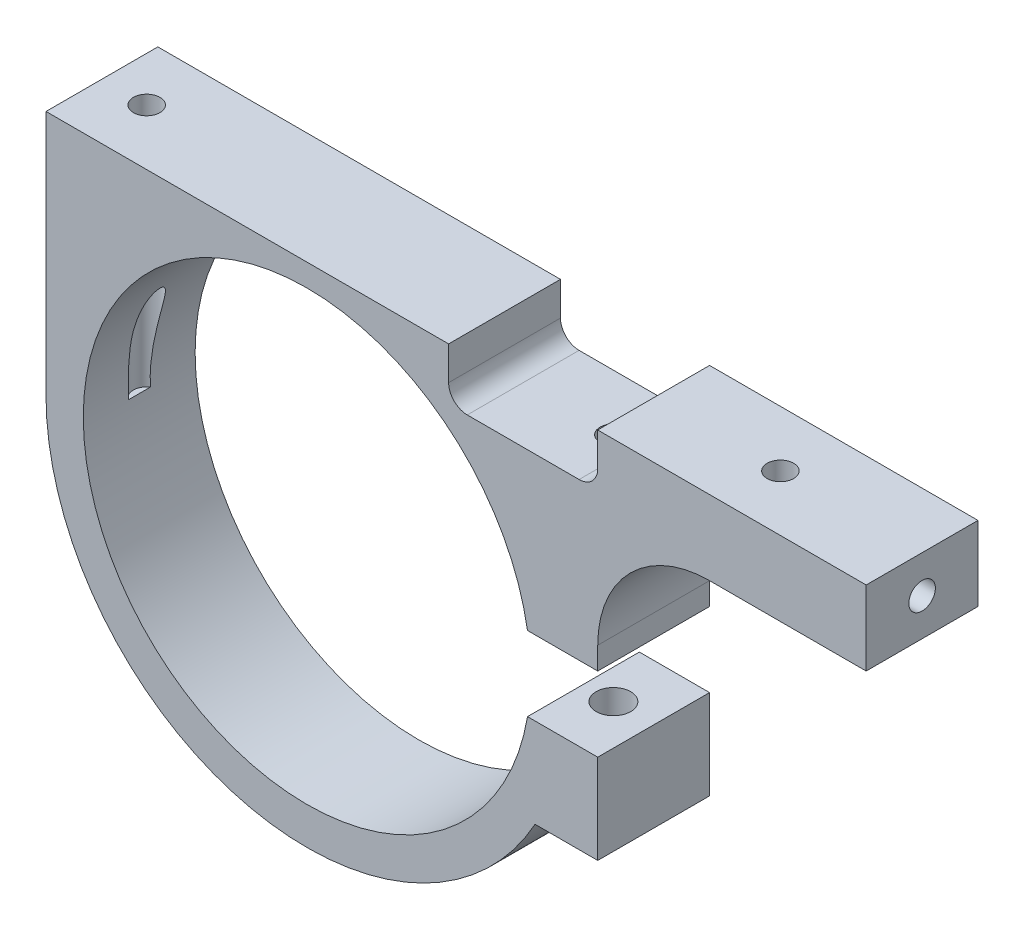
ISO-10303-21;
HEADER;
FILE_DESCRIPTION(('STEP AP214'),'2;1');
FILE_NAME('part.step','',(''),(''),'','','');
FILE_SCHEMA(('AUTOMOTIVE_DESIGN { 1 0 10303 214 1 1 1 1 }'));
ENDSEC;
DATA;
#1=APPLICATION_CONTEXT('core data for automotive mechanical design processes');
#2=APPLICATION_PROTOCOL_DEFINITION('international standard','automotive_design',2000,#1);
#3=PRODUCT_CONTEXT('',#1,'mechanical');
#4=PRODUCT('Part','Part','',(#3));
#5=PRODUCT_RELATED_PRODUCT_CATEGORY('part','',(#4));
#6=PRODUCT_DEFINITION_FORMATION('','',#4);
#7=PRODUCT_DEFINITION_CONTEXT('part definition',#1,'design');
#8=PRODUCT_DEFINITION('design','',#6,#7);
#9=PRODUCT_DEFINITION_SHAPE('','',#8);
#10=(LENGTH_UNIT() NAMED_UNIT(*) SI_UNIT(.MILLI.,.METRE.));
#11=(NAMED_UNIT(*) PLANE_ANGLE_UNIT() SI_UNIT($,.RADIAN.));
#12=(NAMED_UNIT(*) SI_UNIT($,.STERADIAN.) SOLID_ANGLE_UNIT());
#13=UNCERTAINTY_MEASURE_WITH_UNIT(LENGTH_MEASURE(1.E-05),#10,'distance_accuracy_value','');
#14=(GEOMETRIC_REPRESENTATION_CONTEXT(3) GLOBAL_UNCERTAINTY_ASSIGNED_CONTEXT((#13)) GLOBAL_UNIT_ASSIGNED_CONTEXT((#10,
#11,#12)) REPRESENTATION_CONTEXT('',''));
#15=CARTESIAN_POINT('',(0.,0.,0.));
#16=DIRECTION('',(0.,0.,1.));
#17=DIRECTION('',(1.,0.,0.));
#18=AXIS2_PLACEMENT_3D('',#15,#16,#17);
#19=CARTESIAN_POINT('',(0.,0.,4.7625));
#20=DIRECTION('',(0.,0.,-1.));
#21=DIRECTION('',(-1.,0.,0.));
#22=AXIS2_PLACEMENT_3D('',#19,#20,#21);
#23=CYLINDRICAL_SURFACE('',#22,22.225);
#24=CARTESIAN_POINT('',(19.4272643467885,-10.795,2.53719396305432));
#25=CARTESIAN_POINT('',(19.3666154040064,-10.9041738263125,2.49151799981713));
#26=CARTESIAN_POINT('',(19.3056095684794,-11.0117695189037,2.44225961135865));
#27=CARTESIAN_POINT('',(19.1834274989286,-11.2232597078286,2.33532574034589));
#28=CARTESIAN_POINT('',(19.1222515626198,-11.3271376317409,2.27761729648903));
#29=CARTESIAN_POINT('',(18.9998856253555,-11.531234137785,2.15197065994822));
#30=CARTESIAN_POINT('',(18.9387084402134,-11.6313772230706,2.08389550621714));
#31=CARTESIAN_POINT('',(18.8186000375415,-11.8247127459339,1.93708786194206));
#32=CARTESIAN_POINT('',(18.7596650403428,-11.9179171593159,1.85837442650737));
#33=CARTESIAN_POINT('',(18.6436628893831,-12.0986098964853,1.68614331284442));
#34=CARTESIAN_POINT('',(18.5867274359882,-12.185795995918,1.59221317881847));
#35=CARTESIAN_POINT('',(18.4796524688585,-12.3475686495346,1.39099372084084));
#36=CARTESIAN_POINT('',(18.4294935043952,-12.4221914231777,1.2837444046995));
#37=CARTESIAN_POINT('',(18.3384391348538,-12.5562318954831,1.05388028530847));
#38=CARTESIAN_POINT('',(18.2976833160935,-12.6154219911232,0.931071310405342));
#39=CARTESIAN_POINT('',(18.2472778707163,-12.688118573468,0.738143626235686));
#40=CARTESIAN_POINT('',(18.2322641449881,-12.7096692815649,0.672382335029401));
#41=CARTESIAN_POINT('',(18.2062490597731,-12.746906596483,0.53846132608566));
#42=CARTESIAN_POINT('',(18.1952466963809,-12.7625946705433,0.470302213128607));
#43=CARTESIAN_POINT('',(18.1713502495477,-12.7966168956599,0.28257868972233));
#44=CARTESIAN_POINT('',(18.1627671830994,-12.8087672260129,0.161233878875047));
#45=CARTESIAN_POINT('',(18.1597284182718,-12.8130752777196,-0.0818998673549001));
#46=CARTESIAN_POINT('',(18.1652658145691,-12.80524277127,-0.203688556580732));
#47=CARTESIAN_POINT('',(18.187964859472,-12.7729734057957,-0.425555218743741));
#48=CARTESIAN_POINT('',(18.2033183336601,-12.7511177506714,-0.526214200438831));
#49=CARTESIAN_POINT('',(18.2425996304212,-12.6948556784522,-0.722145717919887));
#50=CARTESIAN_POINT('',(18.2665288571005,-12.66044720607,-0.817417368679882));
#51=CARTESIAN_POINT('',(18.3316587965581,-12.5660360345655,-1.03530222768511));
#52=CARTESIAN_POINT('',(18.3759732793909,-12.5012738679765,-1.15491901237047));
#53=CARTESIAN_POINT('',(18.4739194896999,-12.3560772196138,-1.37995133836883));
#54=CARTESIAN_POINT('',(18.5275708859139,-12.2756096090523,-1.48533604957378));
#55=CARTESIAN_POINT('',(18.6688925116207,-12.060126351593,-1.73090110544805));
#56=CARTESIAN_POINT('',(18.7602688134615,-11.9178093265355,-1.86252962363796));
#57=CARTESIAN_POINT('',(18.9015283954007,-11.6914906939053,-2.03952834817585));
#58=CARTESIAN_POINT('',(18.9493942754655,-11.6137756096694,-2.0951933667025));
#59=CARTESIAN_POINT('',(19.0459509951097,-11.4547362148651,-2.20031597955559));
#60=CARTESIAN_POINT('',(19.0946415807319,-11.3734130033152,-2.24977544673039));
#61=CARTESIAN_POINT('',(19.1908646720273,-11.2102651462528,-2.34164875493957));
#62=CARTESIAN_POINT('',(19.2383884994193,-11.1285275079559,-2.38422851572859));
#63=CARTESIAN_POINT('',(19.3330927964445,-10.9631752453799,-2.46430186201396));
#64=CARTESIAN_POINT('',(19.3802735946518,-10.8795750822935,-2.50182484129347));
#65=CARTESIAN_POINT('',(19.4272643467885,-10.795,-2.53719396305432));
#66=B_SPLINE_CURVE_WITH_KNOTS('',3,(#24,#25,#26,#27,#28,#29,#30,#31,#32,#33,#34,#35,#36,#37,#38,
#39,#40,#41,#42,#43,#44,#45,#46,#47,#48,#49,#50,#51,#52,#53,#54,#55,#56,#57,#58,#59,#60,#61,#62,
#63,#64,#65),.UNSPECIFIED.,.F.,.F.,(4,2,2,2,2,2,2,2,2,2,2,2,2,2,2,2,2,2,2,2,4),(0.,
0.399026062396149,0.799652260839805,1.20612328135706,1.61187565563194,2.03142808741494,
2.44974945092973,2.87392987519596,3.08601822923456,3.29805346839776,3.66228868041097,
4.02634580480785,4.33744313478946,4.64859142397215,5.07536822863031,5.50305519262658,
6.14216261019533,6.46274643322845,6.78323326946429,7.09417881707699,7.40323083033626),.UNSPECIFIED.);
#67=CARTESIAN_POINT('',(19.4272643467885,-10.795,2.53719396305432));
#68=VERTEX_POINT('',#67);
#69=CARTESIAN_POINT('',(19.4272643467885,-10.795,-2.53719396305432));
#70=VERTEX_POINT('',#69);
#71=EDGE_CURVE('E190',#68,#70,#66,.T.);
#72=ORIENTED_EDGE('',*,*,#71,.F.);
#73=DIRECTION('',(0.,0.,-1.));
#74=VECTOR('',#73,1.);
#75=CARTESIAN_POINT('',(19.4272643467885,-10.795,4.7625));
#76=LINE('',#75,#74);
#77=CARTESIAN_POINT('',(19.4272643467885,-10.795,4.7625));
#78=VERTEX_POINT('',#77);
#79=EDGE_CURVE('E196',#78,#68,#76,.T.);
#80=ORIENTED_EDGE('',*,*,#79,.F.);
#81=CARTESIAN_POINT('',(0.,0.,4.7625));
#82=DIRECTION('',(0.,0.,1.));
#83=DIRECTION('',(1.,0.,0.));
#84=AXIS2_PLACEMENT_3D('',#81,#82,#83);
#85=CIRCLE('',#84,22.225);
#86=CARTESIAN_POINT('',(-22.225,0.,4.7625));
#87=VERTEX_POINT('',#86);
#88=EDGE_CURVE('E384',#87,#78,#85,.T.);
#89=ORIENTED_EDGE('',*,*,#88,.F.);
#90=DIRECTION('',(0.,0.,-1.));
#91=VECTOR('',#90,1.);
#92=CARTESIAN_POINT('',(-22.225,0.,4.7625));
#93=LINE('',#92,#91);
#94=CARTESIAN_POINT('',(-22.225,0.,-4.7625));
#95=VERTEX_POINT('',#94);
#96=EDGE_CURVE('E206',#87,#95,#93,.T.);
#97=ORIENTED_EDGE('',*,*,#96,.T.);
#98=CARTESIAN_POINT('',(0.,0.,-4.7625));
#99=DIRECTION('',(0.,0.,1.));
#100=DIRECTION('',(1.,0.,0.));
#101=AXIS2_PLACEMENT_3D('',#98,#99,#100);
#102=CIRCLE('',#101,22.225);
#103=CARTESIAN_POINT('',(19.4272643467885,-10.795,-4.7625));
#104=VERTEX_POINT('',#103);
#105=EDGE_CURVE('E420',#95,#104,#102,.T.);
#106=ORIENTED_EDGE('',*,*,#105,.T.);
#107=EDGE_CURVE('E199',#70,#104,#76,.T.);
#108=ORIENTED_EDGE('',*,*,#107,.F.);
#109=EDGE_LOOP('',(#72,#80,#89,#97,#106,#108));
#110=FACE_BOUND('',#109,.T.);
#111=ADVANCED_FACE('F34',(#110),#23,.T.);
#112=CARTESIAN_POINT('',(12.065,20.955,4.7625));
#113=DIRECTION('',(-1.,0.,0.));
#114=DIRECTION('',(0.,-1.,0.));
#115=AXIS2_PLACEMENT_3D('',#112,#113,#114);
#116=PLANE('',#115);
#117=DIRECTION('',(0.,1.,0.));
#118=VECTOR('',#117,1.);
#119=CARTESIAN_POINT('',(12.065,20.955,-4.7625));
#120=LINE('',#119,#118);
#121=CARTESIAN_POINT('',(12.065,18.0975,-4.7625));
#122=VERTEX_POINT('',#121);
#123=CARTESIAN_POINT('',(12.065,20.955,-4.7625));
#124=VERTEX_POINT('',#123);
#125=EDGE_CURVE('E375',#122,#124,#120,.T.);
#126=ORIENTED_EDGE('',*,*,#125,.T.);
#127=DIRECTION('',(0.,0.,-1.));
#128=VECTOR('',#127,1.);
#129=CARTESIAN_POINT('',(12.065,20.955,4.7625));
#130=LINE('',#129,#128);
#131=CARTESIAN_POINT('',(12.065,20.955,4.7625));
#132=VERTEX_POINT('',#131);
#133=EDGE_CURVE('E217',#132,#124,#130,.T.);
#134=ORIENTED_EDGE('',*,*,#133,.F.);
#135=DIRECTION('',(0.,1.,0.));
#136=VECTOR('',#135,1.);
#137=CARTESIAN_POINT('',(12.065,20.955,4.7625));
#138=LINE('',#137,#136);
#139=CARTESIAN_POINT('',(12.065,18.0975,4.7625));
#140=VERTEX_POINT('',#139);
#141=EDGE_CURVE('E376',#140,#132,#138,.T.);
#142=ORIENTED_EDGE('',*,*,#141,.F.);
#143=DIRECTION('',(0.,0.,-1.));
#144=VECTOR('',#143,1.);
#145=CARTESIAN_POINT('',(12.065,18.0975,4.7625));
#146=LINE('',#145,#144);
#147=EDGE_CURVE('E413',#140,#122,#146,.T.);
#148=ORIENTED_EDGE('',*,*,#147,.T.);
#149=EDGE_LOOP('',(#126,#134,#142,#148));
#150=FACE_BOUND('',#149,.T.);
#151=ADVANCED_FACE('F36',(#150),#116,.F.);
#152=CARTESIAN_POINT('',(-22.225,20.955,4.7625));
#153=DIRECTION('',(0.,-1.,0.));
#154=DIRECTION('',(1.,0.,0.));
#155=AXIS2_PLACEMENT_3D('',#152,#153,#154);
#156=PLANE('',#155);
#157=CARTESIAN_POINT('',(-18.415,20.955,0.));
#158=DIRECTION('',(0.,1.,0.));
#159=DIRECTION('',(0.,0.,1.));
#160=AXIS2_PLACEMENT_3D('',#157,#158,#159);
#161=CIRCLE('',#160,1.1303);
#162=CARTESIAN_POINT('',(-18.415,20.955,1.1303));
#163=VERTEX_POINT('',#162);
#164=EDGE_CURVE('E363',#163,#163,#161,.T.);
#165=ORIENTED_EDGE('',*,*,#164,.F.);
#166=EDGE_LOOP('',(#165));
#167=FACE_BOUND('',#166,.T.);
#168=DIRECTION('',(-1.,0.,0.));
#169=VECTOR('',#168,1.);
#170=CARTESIAN_POINT('',(-22.225,20.955,-4.7625));
#171=LINE('',#170,#169);
#172=CARTESIAN_POINT('',(-22.225,20.955,-4.7625));
#173=VERTEX_POINT('',#172);
#174=EDGE_CURVE('E416',#124,#173,#171,.T.);
#175=ORIENTED_EDGE('',*,*,#174,.T.);
#176=DIRECTION('',(0.,0.,-1.));
#177=VECTOR('',#176,1.);
#178=CARTESIAN_POINT('',(-22.225,20.955,4.7625));
#179=LINE('',#178,#177);
#180=CARTESIAN_POINT('',(-22.225,20.955,4.7625));
#181=VERTEX_POINT('',#180);
#182=EDGE_CURVE('E209',#181,#173,#179,.T.);
#183=ORIENTED_EDGE('',*,*,#182,.F.);
#184=DIRECTION('',(-1.,0.,0.));
#185=VECTOR('',#184,1.);
#186=CARTESIAN_POINT('',(-22.225,20.955,4.7625));
#187=LINE('',#186,#185);
#188=EDGE_CURVE('E379',#132,#181,#187,.T.);
#189=ORIENTED_EDGE('',*,*,#188,.F.);
#190=ORIENTED_EDGE('',*,*,#133,.T.);
#191=EDGE_LOOP('',(#175,#183,#189,#190));
#192=FACE_BOUND('',#191,.T.);
#193=ADVANCED_FACE('F315',(#167,#192),#156,.F.);
#194=CARTESIAN_POINT('',(-22.225,20.955,4.7625));
#195=DIRECTION('',(1.,0.,0.));
#196=DIRECTION('',(0.,1.,0.));
#197=AXIS2_PLACEMENT_3D('',#194,#195,#196);
#198=PLANE('',#197);
#199=DIRECTION('',(0.,-1.,0.));
#200=VECTOR('',#199,1.);
#201=CARTESIAN_POINT('',(-22.225,20.955,-4.7625));
#202=LINE('',#201,#200);
#203=EDGE_CURVE('E418',#173,#95,#202,.T.);
#204=ORIENTED_EDGE('',*,*,#203,.T.);
#205=ORIENTED_EDGE('',*,*,#96,.F.);
#206=DIRECTION('',(0.,-1.,0.));
#207=VECTOR('',#206,1.);
#208=CARTESIAN_POINT('',(-22.225,20.955,4.7625));
#209=LINE('',#208,#207);
#210=EDGE_CURVE('E382',#181,#87,#209,.T.);
#211=ORIENTED_EDGE('',*,*,#210,.F.);
#212=ORIENTED_EDGE('',*,*,#182,.T.);
#213=EDGE_LOOP('',(#204,#205,#211,#212));
#214=FACE_BOUND('',#213,.T.);
#215=ADVANCED_FACE('F321',(#214),#198,.F.);
#216=CARTESIAN_POINT('',(24.765,-10.795,4.7625));
#217=DIRECTION('',(0.,1.,0.));
#218=DIRECTION('',(-1.,0.,0.));
#219=AXIS2_PLACEMENT_3D('',#216,#217,#218);
#220=PLANE('',#219);
#221=ORIENTED_EDGE('',*,*,#79,.T.);
#222=CARTESIAN_POINT('',(21.336,-10.795,0.));
#223=DIRECTION('',(0.,-1.,0.));
#224=DIRECTION('',(1.,0.,0.));
#225=AXIS2_PLACEMENT_3D('',#222,#223,#224);
#226=CIRCLE('',#225,3.175);
#227=EDGE_CURVE('E51',#68,#70,#226,.T.);
#228=ORIENTED_EDGE('',*,*,#227,.T.);
#229=ORIENTED_EDGE('',*,*,#107,.T.);
#230=DIRECTION('',(1.,0.,0.));
#231=VECTOR('',#230,1.);
#232=CARTESIAN_POINT('',(24.765,-10.795,-4.7625));
#233=LINE('',#232,#231);
#234=CARTESIAN_POINT('',(24.765,-10.795,-4.7625));
#235=VERTEX_POINT('',#234);
#236=EDGE_CURVE('E422',#104,#235,#233,.T.);
#237=ORIENTED_EDGE('',*,*,#236,.T.);
#238=DIRECTION('',(0.,0.,-1.));
#239=VECTOR('',#238,1.);
#240=CARTESIAN_POINT('',(24.765,-10.795,4.7625));
#241=LINE('',#240,#239);
#242=CARTESIAN_POINT('',(24.765,-10.795,4.7625));
#243=VERTEX_POINT('',#242);
#244=EDGE_CURVE('E211',#243,#235,#241,.T.);
#245=ORIENTED_EDGE('',*,*,#244,.F.);
#246=DIRECTION('',(1.,0.,0.));
#247=VECTOR('',#246,1.);
#248=CARTESIAN_POINT('',(24.765,-10.795,4.7625));
#249=LINE('',#248,#247);
#250=EDGE_CURVE('E205',#78,#243,#249,.T.);
#251=ORIENTED_EDGE('',*,*,#250,.F.);
#252=EDGE_LOOP('',(#221,#228,#229,#237,#245,#251));
#253=FACE_BOUND('',#252,.T.);
#254=CARTESIAN_POINT('',(21.336,-10.795,0.));
#255=DIRECTION('',(0.,-1.,0.));
#256=DIRECTION('',(1.,0.,0.));
#257=AXIS2_PLACEMENT_3D('',#254,#255,#256);
#258=CIRCLE('',#257,1.4732);
#259=CARTESIAN_POINT('',(22.8092,-10.795,0.));
#260=VERTEX_POINT('',#259);
#261=EDGE_CURVE('E355',#260,#260,#258,.T.);
#262=ORIENTED_EDGE('',*,*,#261,.F.);
#263=EDGE_LOOP('',(#262));
#264=FACE_BOUND('',#263,.T.);
#265=ADVANCED_FACE('F202',(#253,#264),#220,.F.);
#266=CARTESIAN_POINT('',(24.765,-10.795,4.7625));
#267=DIRECTION('',(-1.,0.,0.));
#268=DIRECTION('',(0.,0.,1.));
#269=AXIS2_PLACEMENT_3D('',#266,#267,#268);
#270=PLANE('',#269);
#271=DIRECTION('',(0.,1.,0.));
#272=VECTOR('',#271,1.);
#273=CARTESIAN_POINT('',(24.765,-10.795,-4.7625));
#274=LINE('',#273,#272);
#275=CARTESIAN_POINT('',(24.765,-3.175,-4.7625));
#276=VERTEX_POINT('',#275);
#277=EDGE_CURVE('E424',#235,#276,#274,.T.);
#278=ORIENTED_EDGE('',*,*,#277,.T.);
#279=DIRECTION('',(0.,0.,-1.));
#280=VECTOR('',#279,1.);
#281=CARTESIAN_POINT('',(24.765,-3.175,4.7625));
#282=LINE('',#281,#280);
#283=CARTESIAN_POINT('',(24.765,-3.175,4.7625));
#284=VERTEX_POINT('',#283);
#285=EDGE_CURVE('E483',#284,#276,#282,.T.);
#286=ORIENTED_EDGE('',*,*,#285,.F.);
#287=DIRECTION('',(0.,1.,0.));
#288=VECTOR('',#287,1.);
#289=CARTESIAN_POINT('',(24.765,-10.795,4.7625));
#290=LINE('',#289,#288);
#291=EDGE_CURVE('E387',#243,#284,#290,.T.);
#292=ORIENTED_EDGE('',*,*,#291,.F.);
#293=ORIENTED_EDGE('',*,*,#244,.T.);
#294=EDGE_LOOP('',(#278,#286,#292,#293));
#295=FACE_BOUND('',#294,.T.);
#296=ADVANCED_FACE('F493',(#295),#270,.F.);
#297=CARTESIAN_POINT('',(24.765,-3.175,4.7625));
#298=DIRECTION('',(0.,-1.,0.));
#299=DIRECTION('',(1.,0.,0.));
#300=AXIS2_PLACEMENT_3D('',#297,#298,#299);
#301=PLANE('',#300);
#302=CARTESIAN_POINT('',(21.336,-3.175,0.));
#303=DIRECTION('',(0.,-1.,0.));
#304=DIRECTION('',(1.,0.,0.));
#305=AXIS2_PLACEMENT_3D('',#302,#303,#304);
#306=CIRCLE('',#305,1.4732);
#307=CARTESIAN_POINT('',(22.8092,-3.175,0.));
#308=VERTEX_POINT('',#307);
#309=EDGE_CURVE('E358',#308,#308,#306,.F.);
#310=ORIENTED_EDGE('',*,*,#309,.F.);
#311=EDGE_LOOP('',(#310));
#312=FACE_BOUND('',#311,.T.);
#313=DIRECTION('',(-1.,0.,0.));
#314=VECTOR('',#313,1.);
#315=CARTESIAN_POINT('',(24.765,-3.175,-4.7625));
#316=LINE('',#315,#314);
#317=CARTESIAN_POINT('',(18.7835533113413,-3.175,-4.7625));
#318=VERTEX_POINT('',#317);
#319=EDGE_CURVE('E426',#276,#318,#316,.T.);
#320=ORIENTED_EDGE('',*,*,#319,.T.);
#321=DIRECTION('',(0.,0.,-1.));
#322=VECTOR('',#321,1.);
#323=CARTESIAN_POINT('',(18.7835533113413,-3.175,4.7625));
#324=LINE('',#323,#322);
#325=CARTESIAN_POINT('',(18.7835533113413,-3.175,4.7625));
#326=VERTEX_POINT('',#325);
#327=EDGE_CURVE('E481',#326,#318,#324,.T.);
#328=ORIENTED_EDGE('',*,*,#327,.F.);
#329=DIRECTION('',(-1.,0.,0.));
#330=VECTOR('',#329,1.);
#331=CARTESIAN_POINT('',(24.765,-3.175,4.7625));
#332=LINE('',#331,#330);
#333=EDGE_CURVE('E389',#284,#326,#332,.T.);
#334=ORIENTED_EDGE('',*,*,#333,.F.);
#335=ORIENTED_EDGE('',*,*,#285,.T.);
#336=EDGE_LOOP('',(#320,#328,#334,#335));
#337=FACE_BOUND('',#336,.T.);
#338=ADVANCED_FACE('F306',(#312,#337),#301,.F.);
#339=CARTESIAN_POINT('',(0.,0.,4.7625));
#340=DIRECTION('',(0.,0.,-1.));
#341=DIRECTION('',(-1.,0.,0.));
#342=AXIS2_PLACEMENT_3D('',#339,#340,#341);
#343=CYLINDRICAL_SURFACE('',#342,19.05);
#344=DIRECTION('',(0.,0.,-1.));
#345=VECTOR('',#344,1.);
#346=CARTESIAN_POINT('',(-19.0394137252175,-0.635000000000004,4.7625));
#347=LINE('',#346,#345);
#348=CARTESIAN_POINT('',(-19.0394137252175,-0.635000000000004,0.942170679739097));
#349=VERTEX_POINT('',#348);
#350=CARTESIAN_POINT('',(-19.0394137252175,-0.635000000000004,-0.942170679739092));
#351=VERTEX_POINT('',#350);
#352=EDGE_CURVE('E220',#349,#351,#347,.T.);
#353=ORIENTED_EDGE('',*,*,#352,.F.);
#354=CARTESIAN_POINT('',(-19.0394137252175,-0.635000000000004,0.942170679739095));
#355=CARTESIAN_POINT('',(-19.0425563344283,-0.540775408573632,0.940084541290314));
#356=CARTESIAN_POINT('',(-19.0449996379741,-0.446519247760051,0.938446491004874));
#357=CARTESIAN_POINT('',(-19.0484866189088,-0.257969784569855,0.936097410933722));
#358=CARTESIAN_POINT('',(-19.0495302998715,-0.163676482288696,0.935386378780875));
#359=CARTESIAN_POINT('',(-19.0505603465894,0.119204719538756,0.93469010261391));
#360=CARTESIAN_POINT('',(-19.0484462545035,0.307810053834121,0.936141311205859));
#361=CARTESIAN_POINT('',(-19.0385992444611,0.685651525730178,0.942727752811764));
#362=CARTESIAN_POINT('',(-19.0308411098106,0.874886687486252,0.947879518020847));
#363=CARTESIAN_POINT('',(-19.0096960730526,1.25291284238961,0.961285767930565));
#364=CARTESIAN_POINT('',(-18.9963096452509,1.44170387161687,0.969539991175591));
#365=CARTESIAN_POINT('',(-18.9638095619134,1.82009805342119,0.988301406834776));
#366=CARTESIAN_POINT('',(-18.944653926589,2.00969675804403,0.998824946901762));
#367=CARTESIAN_POINT('',(-18.9006710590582,2.38818645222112,1.0209343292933));
#368=CARTESIAN_POINT('',(-18.8758433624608,2.5770773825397,1.03252025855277));
#369=CARTESIAN_POINT('',(-18.8204991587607,2.95426608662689,1.05548429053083));
#370=CARTESIAN_POINT('',(-18.7899759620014,3.14256289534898,1.06686213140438));
#371=CARTESIAN_POINT('',(-18.7232709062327,3.51824106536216,1.0880128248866));
#372=CARTESIAN_POINT('',(-18.6870892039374,3.70562245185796,1.0977857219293));
#373=CARTESIAN_POINT('',(-18.6092448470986,4.07855810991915,1.11419188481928));
#374=CARTESIAN_POINT('',(-18.5676061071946,4.26411676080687,1.12083830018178));
#375=CARTESIAN_POINT('',(-18.4787663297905,4.63398917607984,1.12938287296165));
#376=CARTESIAN_POINT('',(-18.4315663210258,4.81830316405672,1.13128190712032));
#377=CARTESIAN_POINT('',(-18.3317732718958,5.18503938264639,1.1283350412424));
#378=CARTESIAN_POINT('',(-18.2791910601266,5.36746462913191,1.12350244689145));
#379=CARTESIAN_POINT('',(-18.168745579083,5.73018894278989,1.10457742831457));
#380=CARTESIAN_POINT('',(-18.1108853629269,5.91048917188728,1.09049032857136));
#381=CARTESIAN_POINT('',(-18.0166610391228,6.18980697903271,1.05838471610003));
#382=CARTESIAN_POINT('',(-17.9819603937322,6.28989296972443,1.0447787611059));
#383=CARTESIAN_POINT('',(-17.9111337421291,6.4888312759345,1.01253010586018));
#384=CARTESIAN_POINT('',(-17.8750069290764,6.58768285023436,0.993884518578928));
#385=CARTESIAN_POINT('',(-17.8015372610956,6.78371179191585,0.950299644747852));
#386=CARTESIAN_POINT('',(-17.7641928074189,6.88088667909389,0.925351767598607));
#387=CARTESIAN_POINT('',(-17.6887773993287,7.07249655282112,0.867439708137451));
#388=CARTESIAN_POINT('',(-17.6507073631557,7.1669346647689,0.834485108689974));
#389=CARTESIAN_POINT('',(-17.5934766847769,7.30579470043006,0.776796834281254));
#390=CARTESIAN_POINT('',(-17.574274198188,7.35185763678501,0.756055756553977));
#391=CARTESIAN_POINT('',(-17.5360969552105,7.44246010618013,0.711319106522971));
#392=CARTESIAN_POINT('',(-17.5171220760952,7.48700048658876,0.687325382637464));
#393=CARTESIAN_POINT('',(-17.4798090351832,7.57370377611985,0.63561484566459));
#394=CARTESIAN_POINT('',(-17.4614674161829,7.61588081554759,0.60792451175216));
#395=CARTESIAN_POINT('',(-17.4257675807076,7.69721274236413,0.547919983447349));
#396=CARTESIAN_POINT('',(-17.4084075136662,7.73637337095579,0.515614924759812));
#397=CARTESIAN_POINT('',(-17.3809690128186,7.79776516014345,0.457185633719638));
#398=CARTESIAN_POINT('',(-17.3704037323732,7.82126375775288,0.432631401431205));
#399=CARTESIAN_POINT('',(-17.3503810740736,7.86558112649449,0.380709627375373));
#400=CARTESIAN_POINT('',(-17.3409248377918,7.88639713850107,0.353339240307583));
#401=CARTESIAN_POINT('',(-17.3235326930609,7.92452896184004,0.295304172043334));
#402=CARTESIAN_POINT('',(-17.3156144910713,7.94180412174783,0.264606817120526));
#403=CARTESIAN_POINT('',(-17.3021172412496,7.97116699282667,0.200346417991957));
#404=CARTESIAN_POINT('',(-17.2965325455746,7.98326723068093,0.166790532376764));
#405=CARTESIAN_POINT('',(-17.2893604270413,7.99878559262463,0.105908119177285));
#406=CARTESIAN_POINT('',(-17.2871364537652,8.00358801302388,0.0790110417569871));
#407=CARTESIAN_POINT('',(-17.2846442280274,8.00896895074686,0.0247091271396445));
#408=CARTESIAN_POINT('',(-17.2843747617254,8.00955008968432,-0.0026953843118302));
#409=CARTESIAN_POINT('',(-17.2858184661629,8.00643380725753,-0.0571854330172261));
#410=CARTESIAN_POINT('',(-17.2875305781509,8.00273867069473,-0.0842711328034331));
#411=CARTESIAN_POINT('',(-17.292766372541,7.99141847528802,-0.137423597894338));
#412=CARTESIAN_POINT('',(-17.2962915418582,7.98379019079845,-0.163489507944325));
#413=CARTESIAN_POINT('',(-17.3063618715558,7.96194240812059,-0.222929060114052));
#414=CARTESIAN_POINT('',(-17.3135310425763,7.9463530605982,-0.255689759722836));
#415=CARTESIAN_POINT('',(-17.329890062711,7.91061304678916,-0.318056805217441));
#416=CARTESIAN_POINT('',(-17.3390844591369,7.89045211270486,-0.347655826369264));
#417=CARTESIAN_POINT('',(-17.3650148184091,7.83327840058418,-0.421244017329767));
#418=CARTESIAN_POINT('',(-17.3828835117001,7.79358574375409,-0.462726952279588));
#419=CARTESIAN_POINT('',(-17.4205471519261,7.70903384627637,-0.538936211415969));
#420=CARTESIAN_POINT('',(-17.4403470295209,7.664161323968,-0.573644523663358));
#421=CARTESIAN_POINT('',(-17.4810900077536,7.57077338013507,-0.637842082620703));
#422=CARTESIAN_POINT('',(-17.5020409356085,7.52223186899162,-0.667287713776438));
#423=CARTESIAN_POINT('',(-17.5444142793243,7.42286688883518,-0.721697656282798));
#424=CARTESIAN_POINT('',(-17.5658371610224,7.37204110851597,-0.746657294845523));
#425=CARTESIAN_POINT('',(-17.6088516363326,7.2686989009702,-0.792906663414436));
#426=CARTESIAN_POINT('',(-17.6304434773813,7.21617937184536,-0.814189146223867));
#427=CARTESIAN_POINT('',(-17.6735371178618,7.10998390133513,-0.853616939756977));
#428=CARTESIAN_POINT('',(-17.6950389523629,7.05630847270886,-0.871763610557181));
#429=CARTESIAN_POINT('',(-17.7489973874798,6.91978562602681,-0.914187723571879));
#430=CARTESIAN_POINT('',(-17.7813116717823,6.83634032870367,-0.93671874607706));
#431=CARTESIAN_POINT('',(-17.8451390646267,6.66795557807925,-0.976859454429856));
#432=CARTESIAN_POINT('',(-17.8766517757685,6.58301541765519,-0.994466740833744));
#433=CARTESIAN_POINT('',(-17.9387375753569,6.4119022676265,-1.02565147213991));
#434=CARTESIAN_POINT('',(-17.9693090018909,6.32572745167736,-1.03922211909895));
#435=CARTESIAN_POINT('',(-18.0293474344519,6.15252301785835,-1.06296251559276));
#436=CARTESIAN_POINT('',(-18.0588142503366,6.06549325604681,-1.07313168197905));
#437=CARTESIAN_POINT('',(-18.1457432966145,5.80247332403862,-1.09944291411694));
#438=CARTESIAN_POINT('',(-18.2014083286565,5.62544929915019,-1.1112378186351));
#439=CARTESIAN_POINT('',(-18.3075551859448,5.26975987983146,-1.12645026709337));
#440=CARTESIAN_POINT('',(-18.3580421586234,5.09109631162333,-1.12987620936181));
#441=CARTESIAN_POINT('',(-18.4661780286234,4.68587242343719,-1.13075100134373));
#442=CARTESIAN_POINT('',(-18.5222912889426,4.4589008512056,-1.12642039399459));
#443=CARTESIAN_POINT('',(-18.626096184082,4.00320929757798,-1.11164613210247));
#444=CARTESIAN_POINT('',(-18.6737854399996,3.77448884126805,-1.10120075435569));
#445=CARTESIAN_POINT('',(-18.7607563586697,3.31529820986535,-1.07706497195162));
#446=CARTESIAN_POINT('',(-18.8000260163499,3.08482601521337,-1.06336999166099));
#447=CARTESIAN_POINT('',(-18.8700541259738,2.62263069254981,-1.03533859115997));
#448=CARTESIAN_POINT('',(-18.9008124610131,2.3909075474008,-1.02100216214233));
#449=CARTESIAN_POINT('',(-18.9536751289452,1.92739887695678,-0.994125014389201));
#450=CARTESIAN_POINT('',(-18.9758167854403,1.69561807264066,-0.981576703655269));
#451=CARTESIAN_POINT('',(-19.0115980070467,1.23120911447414,-0.960253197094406));
#452=CARTESIAN_POINT('',(-19.0252372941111,0.99858093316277,-0.951478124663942));
#453=CARTESIAN_POINT('',(-19.0439618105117,0.533110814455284,-0.939209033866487));
#454=CARTESIAN_POINT('',(-19.0490570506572,0.30026944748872,-0.935708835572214));
#455=CARTESIAN_POINT('',(-19.0507043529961,-0.165432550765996,-0.934590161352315));
#456=CARTESIAN_POINT('',(-19.0472579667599,-0.398293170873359,-0.936970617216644));
#457=CARTESIAN_POINT('',(-19.0395043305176,-0.63227897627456,-0.942110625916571));
#458=CARTESIAN_POINT('',(-19.039459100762,-0.633639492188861,-0.942140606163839));
#459=CARTESIAN_POINT('',(-19.0394137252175,-0.635,-0.942170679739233));
#460=B_SPLINE_CURVE_WITH_KNOTS('',3,(#354,#355,#356,#357,#358,#359,#360,#361,#362,#363,#364,
#365,#366,#367,#368,#369,#370,#371,#372,#373,#374,#375,#376,#377,#378,#379,#380,#381,#382,#383,
#384,#385,#386,#387,#388,#389,#390,#391,#392,#393,#394,#395,#396,#397,#398,#399,#400,#401,#402,
#403,#404,#405,#406,#407,#408,#409,#410,#411,#412,#413,#414,#415,#416,#417,#418,#419,#420,#421,
#422,#423,#424,#425,#426,#427,#428,#429,#430,#431,#432,#433,#434,#435,#436,#437,#438,#439,#440,
#441,#442,#443,#444,#445,#446,#447,#448,#449,#450,#451,#452,#453,#454,#455,#456,#457,#458,#459),
.UNSPECIFIED.,.F.,.F.,(4,2,2,2,2,2,2,2,2,2,2,2,2,2,2,2,2,2,2,2,2,2,2,2,2,2,2,2,2,2,2,2,2,2,2,2,
2,2,2,2,2,2,2,2,2,2,2,2,2,2,2,2,4),(0.,0.282893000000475,0.565785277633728,1.13152140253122,
1.69980079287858,2.26803230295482,2.84050278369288,3.41302015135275,3.98621425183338,
4.55939248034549,5.13013796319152,5.70077803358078,6.27029178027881,6.83947814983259,
7.15977835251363,7.48026243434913,7.80118574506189,8.12172683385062,8.28376761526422,
8.44571669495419,8.60656241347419,8.76709401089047,8.87369065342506,8.98039607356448,
9.08826528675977,9.19587188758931,9.27774383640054,9.35956493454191,9.44134233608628,
9.52318691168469,9.63350846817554,9.74408030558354,9.92345502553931,10.1033003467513,
10.2845732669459,10.4660339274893,10.6478482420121,10.8295835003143,11.106212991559,
11.382977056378,11.6602046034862,11.9374796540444,12.4949209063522,13.0518025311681,
13.753029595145,14.4544543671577,15.1568727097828,15.8593006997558,16.5586512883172,
17.2580247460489,17.9565781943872,18.6550047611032,18.6590895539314),.UNSPECIFIED.);
#461=EDGE_CURVE('E227',#349,#351,#460,.T.);
#462=ORIENTED_EDGE('',*,*,#461,.T.);
#463=EDGE_LOOP('',(#353,#462));
#464=FACE_BOUND('',#463,.T.);
#465=CARTESIAN_POINT('',(0.,0.,-4.7625));
#466=DIRECTION('',(0.,0.,-1.));
#467=DIRECTION('',(1.,0.,0.));
#468=AXIS2_PLACEMENT_3D('',#465,#466,#467);
#469=CIRCLE('',#468,19.05);
#470=CARTESIAN_POINT('',(18.7835533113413,3.175,-4.7625));
#471=VERTEX_POINT('',#470);
#472=EDGE_CURVE('E428',#318,#471,#469,.T.);
#473=ORIENTED_EDGE('',*,*,#472,.T.);
#474=DIRECTION('',(0.,0.,-1.));
#475=VECTOR('',#474,1.);
#476=CARTESIAN_POINT('',(18.7835533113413,3.175,4.7625));
#477=LINE('',#476,#475);
#478=CARTESIAN_POINT('',(18.7835533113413,3.175,4.7625));
#479=VERTEX_POINT('',#478);
#480=EDGE_CURVE('E478',#479,#471,#477,.T.);
#481=ORIENTED_EDGE('',*,*,#480,.F.);
#482=CARTESIAN_POINT('',(0.,0.,4.7625));
#483=DIRECTION('',(0.,0.,-1.));
#484=DIRECTION('',(1.,0.,0.));
#485=AXIS2_PLACEMENT_3D('',#482,#483,#484);
#486=CIRCLE('',#485,19.05);
#487=EDGE_CURVE('E391',#326,#479,#486,.T.);
#488=ORIENTED_EDGE('',*,*,#487,.F.);
#489=ORIENTED_EDGE('',*,*,#327,.T.);
#490=EDGE_LOOP('',(#473,#481,#488,#489));
#491=FACE_BOUND('',#490,.T.);
#492=ADVANCED_FACE('F237',(#464,#491),#343,.F.);
#493=CARTESIAN_POINT('',(24.765,3.175,4.7625));
#494=DIRECTION('',(0.,1.,0.));
#495=DIRECTION('',(-1.,0.,0.));
#496=AXIS2_PLACEMENT_3D('',#493,#494,#495);
#497=PLANE('',#496);
#498=CARTESIAN_POINT('',(21.336,3.175,0.));
#499=DIRECTION('',(0.,1.,0.));
#500=DIRECTION('',(-1.,0.,0.));
#501=AXIS2_PLACEMENT_3D('',#498,#499,#500);
#502=CIRCLE('',#501,1.1303);
#503=CARTESIAN_POINT('',(20.2057,3.175,0.));
#504=VERTEX_POINT('',#503);
#505=EDGE_CURVE('E224',#504,#504,#502,.T.);
#506=ORIENTED_EDGE('',*,*,#505,.T.);
#507=EDGE_LOOP('',(#506));
#508=FACE_BOUND('',#507,.T.);
#509=DIRECTION('',(1.,0.,0.));
#510=VECTOR('',#509,1.);
#511=CARTESIAN_POINT('',(24.765,3.175,-4.7625));
#512=LINE('',#511,#510);
#513=CARTESIAN_POINT('',(24.765,3.175,-4.7625));
#514=VERTEX_POINT('',#513);
#515=EDGE_CURVE('E430',#471,#514,#512,.T.);
#516=ORIENTED_EDGE('',*,*,#515,.T.);
#517=DIRECTION('',(0.,0.,-1.));
#518=VECTOR('',#517,1.);
#519=CARTESIAN_POINT('',(24.765,3.175,4.7625));
#520=LINE('',#519,#518);
#521=CARTESIAN_POINT('',(24.765,3.175,4.7625));
#522=VERTEX_POINT('',#521);
#523=EDGE_CURVE('E475',#522,#514,#520,.T.);
#524=ORIENTED_EDGE('',*,*,#523,.F.);
#525=DIRECTION('',(1.,0.,0.));
#526=VECTOR('',#525,1.);
#527=CARTESIAN_POINT('',(24.765,3.175,4.7625));
#528=LINE('',#527,#526);
#529=EDGE_CURVE('E393',#479,#522,#528,.T.);
#530=ORIENTED_EDGE('',*,*,#529,.F.);
#531=ORIENTED_EDGE('',*,*,#480,.T.);
#532=EDGE_LOOP('',(#516,#524,#530,#531));
#533=FACE_BOUND('',#532,.T.);
#534=ADVANCED_FACE('F299',(#508,#533),#497,.F.);
#535=CARTESIAN_POINT('',(24.765,5.07999999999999,4.7625));
#536=DIRECTION('',(-1.,0.,0.));
#537=DIRECTION('',(0.,-1.,0.));
#538=AXIS2_PLACEMENT_3D('',#535,#536,#537);
#539=PLANE('',#538);
#540=DIRECTION('',(0.,1.,0.));
#541=VECTOR('',#540,1.);
#542=CARTESIAN_POINT('',(24.765,5.07999999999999,-4.7625));
#543=LINE('',#542,#541);
#544=CARTESIAN_POINT('',(24.765,5.07999999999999,-4.7625));
#545=VERTEX_POINT('',#544);
#546=EDGE_CURVE('E432',#514,#545,#543,.T.);
#547=ORIENTED_EDGE('',*,*,#546,.T.);
#548=DIRECTION('',(0.,0.,-1.));
#549=VECTOR('',#548,1.);
#550=CARTESIAN_POINT('',(24.765,5.07999999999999,4.7625));
#551=LINE('',#550,#549);
#552=CARTESIAN_POINT('',(24.765,5.07999999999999,4.7625));
#553=VERTEX_POINT('',#552);
#554=EDGE_CURVE('E472',#553,#545,#551,.T.);
#555=ORIENTED_EDGE('',*,*,#554,.F.);
#556=DIRECTION('',(0.,1.,0.));
#557=VECTOR('',#556,1.);
#558=CARTESIAN_POINT('',(24.765,5.07999999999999,4.7625));
#559=LINE('',#558,#557);
#560=EDGE_CURVE('E395',#522,#553,#559,.T.);
#561=ORIENTED_EDGE('',*,*,#560,.F.);
#562=ORIENTED_EDGE('',*,*,#523,.T.);
#563=EDGE_LOOP('',(#547,#555,#561,#562));
#564=FACE_BOUND('',#563,.T.);
#565=ADVANCED_FACE('F296',(#564),#539,.F.);
#566=CARTESIAN_POINT('',(34.29,5.07999999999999,4.7625));
#567=DIRECTION('',(0.,0.,-1.));
#568=DIRECTION('',(-1.,0.,0.));
#569=AXIS2_PLACEMENT_3D('',#566,#567,#568);
#570=CYLINDRICAL_SURFACE('',#569,9.525);
#571=CARTESIAN_POINT('',(34.29,5.07999999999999,-4.7625));
#572=DIRECTION('',(0.,0.,-1.));
#573=DIRECTION('',(-1.,0.,0.));
#574=AXIS2_PLACEMENT_3D('',#571,#572,#573);
#575=CIRCLE('',#574,9.525);
#576=CARTESIAN_POINT('',(34.29,14.605,-4.7625));
#577=VERTEX_POINT('',#576);
#578=EDGE_CURVE('E434',#545,#577,#575,.T.);
#579=ORIENTED_EDGE('',*,*,#578,.T.);
#580=DIRECTION('',(0.,0.,-1.));
#581=VECTOR('',#580,1.);
#582=CARTESIAN_POINT('',(34.29,14.605,4.7625));
#583=LINE('',#582,#581);
#584=CARTESIAN_POINT('',(34.29,14.605,4.7625));
#585=VERTEX_POINT('',#584);
#586=EDGE_CURVE('E469',#585,#577,#583,.T.);
#587=ORIENTED_EDGE('',*,*,#586,.F.);
#588=CARTESIAN_POINT('',(34.29,5.07999999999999,4.7625));
#589=DIRECTION('',(0.,0.,-1.));
#590=DIRECTION('',(-1.,0.,0.));
#591=AXIS2_PLACEMENT_3D('',#588,#589,#590);
#592=CIRCLE('',#591,9.525);
#593=EDGE_CURVE('E397',#553,#585,#592,.T.);
#594=ORIENTED_EDGE('',*,*,#593,.F.);
#595=ORIENTED_EDGE('',*,*,#554,.T.);
#596=EDGE_LOOP('',(#579,#587,#594,#595));
#597=FACE_BOUND('',#596,.T.);
#598=ADVANCED_FACE('F292',(#597),#570,.F.);
#599=CARTESIAN_POINT('',(34.29,14.605,4.7625));
#600=DIRECTION('',(0.,1.,0.));
#601=DIRECTION('',(-1.,0.,0.));
#602=AXIS2_PLACEMENT_3D('',#599,#600,#601);
#603=PLANE('',#602);
#604=CARTESIAN_POINT('',(35.56,14.605,0.));
#605=DIRECTION('',(0.,1.,0.));
#606=DIRECTION('',(-1.,0.,0.));
#607=AXIS2_PLACEMENT_3D('',#604,#605,#606);
#608=CIRCLE('',#607,1.1303);
#609=CARTESIAN_POINT('',(34.4297,14.605,0.));
#610=VERTEX_POINT('',#609);
#611=EDGE_CURVE('E372',#610,#610,#608,.T.);
#612=ORIENTED_EDGE('',*,*,#611,.T.);
#613=EDGE_LOOP('',(#612));
#614=FACE_BOUND('',#613,.T.);
#615=DIRECTION('',(1.,0.,0.));
#616=VECTOR('',#615,1.);
#617=CARTESIAN_POINT('',(34.29,14.605,-4.7625));
#618=LINE('',#617,#616);
#619=CARTESIAN_POINT('',(47.625,14.605,-4.7625));
#620=VERTEX_POINT('',#619);
#621=EDGE_CURVE('E436',#577,#620,#618,.T.);
#622=ORIENTED_EDGE('',*,*,#621,.T.);
#623=DIRECTION('',(0.,0.,-1.));
#624=VECTOR('',#623,1.);
#625=CARTESIAN_POINT('',(47.625,14.605,4.7625));
#626=LINE('',#625,#624);
#627=CARTESIAN_POINT('',(47.625,14.605,4.7625));
#628=VERTEX_POINT('',#627);
#629=EDGE_CURVE('E466',#628,#620,#626,.T.);
#630=ORIENTED_EDGE('',*,*,#629,.F.);
#631=DIRECTION('',(1.,0.,0.));
#632=VECTOR('',#631,1.);
#633=CARTESIAN_POINT('',(34.29,14.605,4.7625));
#634=LINE('',#633,#632);
#635=EDGE_CURVE('E399',#585,#628,#634,.T.);
#636=ORIENTED_EDGE('',*,*,#635,.F.);
#637=ORIENTED_EDGE('',*,*,#586,.T.);
#638=EDGE_LOOP('',(#622,#630,#636,#637));
#639=FACE_BOUND('',#638,.T.);
#640=ADVANCED_FACE('F288',(#614,#639),#603,.F.);
#641=CARTESIAN_POINT('',(47.625,20.955,4.7625));
#642=DIRECTION('',(-1.,0.,0.));
#643=DIRECTION('',(0.,0.,1.));
#644=AXIS2_PLACEMENT_3D('',#641,#642,#643);
#645=PLANE('',#644);
#646=CARTESIAN_POINT('',(47.625,17.78,0.));
#647=DIRECTION('',(1.,0.,0.));
#648=DIRECTION('',(0.,0.,-1.));
#649=AXIS2_PLACEMENT_3D('',#646,#647,#648);
#650=CIRCLE('',#649,1.1303);
#651=CARTESIAN_POINT('',(47.625,17.78,-1.1303));
#652=VERTEX_POINT('',#651);
#653=EDGE_CURVE('E200',#652,#652,#650,.T.);
#654=ORIENTED_EDGE('',*,*,#653,.F.);
#655=EDGE_LOOP('',(#654));
#656=FACE_BOUND('',#655,.T.);
#657=DIRECTION('',(0.,1.,0.));
#658=VECTOR('',#657,1.);
#659=CARTESIAN_POINT('',(47.625,20.955,-4.7625));
#660=LINE('',#659,#658);
#661=CARTESIAN_POINT('',(47.625,20.955,-4.7625));
#662=VERTEX_POINT('',#661);
#663=EDGE_CURVE('E438',#620,#662,#660,.T.);
#664=ORIENTED_EDGE('',*,*,#663,.T.);
#665=DIRECTION('',(0.,0.,-1.));
#666=VECTOR('',#665,1.);
#667=CARTESIAN_POINT('',(47.625,20.955,4.7625));
#668=LINE('',#667,#666);
#669=CARTESIAN_POINT('',(47.625,20.955,4.7625));
#670=VERTEX_POINT('',#669);
#671=EDGE_CURVE('E463',#670,#662,#668,.T.);
#672=ORIENTED_EDGE('',*,*,#671,.F.);
#673=DIRECTION('',(0.,1.,0.));
#674=VECTOR('',#673,1.);
#675=CARTESIAN_POINT('',(47.625,20.955,4.7625));
#676=LINE('',#675,#674);
#677=EDGE_CURVE('E401',#628,#670,#676,.T.);
#678=ORIENTED_EDGE('',*,*,#677,.F.);
#679=ORIENTED_EDGE('',*,*,#629,.T.);
#680=EDGE_LOOP('',(#664,#672,#678,#679));
#681=FACE_BOUND('',#680,.T.);
#682=ADVANCED_FACE('F284',(#656,#681),#645,.F.);
#683=CARTESIAN_POINT('',(24.765,20.955,4.7625));
#684=DIRECTION('',(0.,-1.,0.));
#685=DIRECTION('',(1.,0.,0.));
#686=AXIS2_PLACEMENT_3D('',#683,#684,#685);
#687=PLANE('',#686);
#688=CARTESIAN_POINT('',(35.56,20.955,0.));
#689=DIRECTION('',(0.,1.,0.));
#690=DIRECTION('',(0.,0.,1.));
#691=AXIS2_PLACEMENT_3D('',#688,#689,#690);
#692=CIRCLE('',#691,1.1303);
#693=CARTESIAN_POINT('',(35.56,20.955,1.1303));
#694=VERTEX_POINT('',#693);
#695=EDGE_CURVE('E360',#694,#694,#692,.T.);
#696=ORIENTED_EDGE('',*,*,#695,.F.);
#697=EDGE_LOOP('',(#696));
#698=FACE_BOUND('',#697,.T.);
#699=DIRECTION('',(-1.,0.,0.));
#700=VECTOR('',#699,1.);
#701=CARTESIAN_POINT('',(24.765,20.955,-4.7625));
#702=LINE('',#701,#700);
#703=CARTESIAN_POINT('',(24.765,20.955,-4.7625));
#704=VERTEX_POINT('',#703);
#705=EDGE_CURVE('E440',#662,#704,#702,.T.);
#706=ORIENTED_EDGE('',*,*,#705,.T.);
#707=DIRECTION('',(0.,0.,-1.));
#708=VECTOR('',#707,1.);
#709=CARTESIAN_POINT('',(24.765,20.955,4.7625));
#710=LINE('',#709,#708);
#711=CARTESIAN_POINT('',(24.765,20.955,4.7625));
#712=VERTEX_POINT('',#711);
#713=EDGE_CURVE('E460',#712,#704,#710,.T.);
#714=ORIENTED_EDGE('',*,*,#713,.F.);
#715=DIRECTION('',(-1.,0.,0.));
#716=VECTOR('',#715,1.);
#717=CARTESIAN_POINT('',(24.765,20.955,4.7625));
#718=LINE('',#717,#716);
#719=EDGE_CURVE('E403',#670,#712,#718,.T.);
#720=ORIENTED_EDGE('',*,*,#719,.F.);
#721=ORIENTED_EDGE('',*,*,#671,.T.);
#722=EDGE_LOOP('',(#706,#714,#720,#721));
#723=FACE_BOUND('',#722,.T.);
#724=ADVANCED_FACE('F280',(#698,#723),#687,.F.);
#725=CARTESIAN_POINT('',(24.765,20.955,4.7625));
#726=DIRECTION('',(1.,0.,0.));
#727=DIRECTION('',(0.,1.,0.));
#728=AXIS2_PLACEMENT_3D('',#725,#726,#727);
#729=PLANE('',#728);
#730=DIRECTION('',(0.,-1.,0.));
#731=VECTOR('',#730,1.);
#732=CARTESIAN_POINT('',(24.765,20.955,-4.7625));
#733=LINE('',#732,#731);
#734=CARTESIAN_POINT('',(24.765,18.0975,-4.7625));
#735=VERTEX_POINT('',#734);
#736=EDGE_CURVE('E442',#704,#735,#733,.T.);
#737=ORIENTED_EDGE('',*,*,#736,.T.);
#738=DIRECTION('',(0.,0.,-1.));
#739=VECTOR('',#738,1.);
#740=CARTESIAN_POINT('',(24.765,18.0975,4.7625));
#741=LINE('',#740,#739);
#742=CARTESIAN_POINT('',(24.765,18.0975,4.7625));
#743=VERTEX_POINT('',#742);
#744=EDGE_CURVE('E457',#743,#735,#741,.T.);
#745=ORIENTED_EDGE('',*,*,#744,.F.);
#746=DIRECTION('',(0.,-1.,0.));
#747=VECTOR('',#746,1.);
#748=CARTESIAN_POINT('',(24.765,20.955,4.7625));
#749=LINE('',#748,#747);
#750=EDGE_CURVE('E405',#712,#743,#749,.T.);
#751=ORIENTED_EDGE('',*,*,#750,.F.);
#752=ORIENTED_EDGE('',*,*,#713,.T.);
#753=EDGE_LOOP('',(#737,#745,#751,#752));
#754=FACE_BOUND('',#753,.T.);
#755=ADVANCED_FACE('F276',(#754),#729,.F.);
#756=CARTESIAN_POINT('',(23.1775,18.0975,4.7625));
#757=DIRECTION('',(0.,0.,-1.));
#758=DIRECTION('',(-1.,0.,0.));
#759=AXIS2_PLACEMENT_3D('',#756,#757,#758);
#760=CYLINDRICAL_SURFACE('',#759,1.5875);
#761=CARTESIAN_POINT('',(23.1775,18.0975,-4.7625));
#762=DIRECTION('',(0.,0.,-1.));
#763=DIRECTION('',(1.,0.,0.));
#764=AXIS2_PLACEMENT_3D('',#761,#762,#763);
#765=CIRCLE('',#764,1.5875);
#766=CARTESIAN_POINT('',(23.1775,16.51,-4.7625));
#767=VERTEX_POINT('',#766);
#768=EDGE_CURVE('E444',#735,#767,#765,.T.);
#769=ORIENTED_EDGE('',*,*,#768,.T.);
#770=DIRECTION('',(0.,0.,-1.));
#771=VECTOR('',#770,1.);
#772=CARTESIAN_POINT('',(23.1775,16.51,4.7625));
#773=LINE('',#772,#771);
#774=CARTESIAN_POINT('',(23.1775,16.51,4.7625));
#775=VERTEX_POINT('',#774);
#776=EDGE_CURVE('E454',#775,#767,#773,.T.);
#777=ORIENTED_EDGE('',*,*,#776,.F.);
#778=CARTESIAN_POINT('',(23.1775,18.0975,4.7625));
#779=DIRECTION('',(0.,0.,-1.));
#780=DIRECTION('',(1.,0.,0.));
#781=AXIS2_PLACEMENT_3D('',#778,#779,#780);
#782=CIRCLE('',#781,1.5875);
#783=EDGE_CURVE('E407',#743,#775,#782,.T.);
#784=ORIENTED_EDGE('',*,*,#783,.F.);
#785=ORIENTED_EDGE('',*,*,#744,.T.);
#786=EDGE_LOOP('',(#769,#777,#784,#785));
#787=FACE_BOUND('',#786,.T.);
#788=ADVANCED_FACE('F272',(#787),#760,.F.);
#789=CARTESIAN_POINT('',(13.6525,16.51,4.7625));
#790=DIRECTION('',(0.,-1.,0.));
#791=DIRECTION('',(1.,0.,0.));
#792=AXIS2_PLACEMENT_3D('',#789,#790,#791);
#793=PLANE('',#792);
#794=CARTESIAN_POINT('',(21.336,16.51,0.));
#795=DIRECTION('',(0.,-1.,0.));
#796=DIRECTION('',(1.,0.,0.));
#797=AXIS2_PLACEMENT_3D('',#794,#795,#796);
#798=CIRCLE('',#797,1.1303);
#799=CARTESIAN_POINT('',(22.4663,16.51,0.));
#800=VERTEX_POINT('',#799);
#801=EDGE_CURVE('E221',#800,#800,#798,.T.);
#802=ORIENTED_EDGE('',*,*,#801,.T.);
#803=EDGE_LOOP('',(#802));
#804=FACE_BOUND('',#803,.T.);
#805=DIRECTION('',(-1.,0.,0.));
#806=VECTOR('',#805,1.);
#807=CARTESIAN_POINT('',(13.6525,16.51,-4.7625));
#808=LINE('',#807,#806);
#809=CARTESIAN_POINT('',(13.6525,16.51,-4.7625));
#810=VERTEX_POINT('',#809);
#811=EDGE_CURVE('E446',#767,#810,#808,.T.);
#812=ORIENTED_EDGE('',*,*,#811,.T.);
#813=DIRECTION('',(0.,0.,-1.));
#814=VECTOR('',#813,1.);
#815=CARTESIAN_POINT('',(13.6525,16.51,4.7625));
#816=LINE('',#815,#814);
#817=CARTESIAN_POINT('',(13.6525,16.51,4.7625));
#818=VERTEX_POINT('',#817);
#819=EDGE_CURVE('E451',#818,#810,#816,.T.);
#820=ORIENTED_EDGE('',*,*,#819,.F.);
#821=DIRECTION('',(-1.,0.,0.));
#822=VECTOR('',#821,1.);
#823=CARTESIAN_POINT('',(13.6525,16.51,4.7625));
#824=LINE('',#823,#822);
#825=EDGE_CURVE('E409',#775,#818,#824,.T.);
#826=ORIENTED_EDGE('',*,*,#825,.F.);
#827=ORIENTED_EDGE('',*,*,#776,.T.);
#828=EDGE_LOOP('',(#812,#820,#826,#827));
#829=FACE_BOUND('',#828,.T.);
#830=ADVANCED_FACE('F268',(#804,#829),#793,.F.);
#831=CARTESIAN_POINT('',(13.6525,18.0975,4.7625));
#832=DIRECTION('',(0.,0.,-1.));
#833=DIRECTION('',(-1.,0.,0.));
#834=AXIS2_PLACEMENT_3D('',#831,#832,#833);
#835=CYLINDRICAL_SURFACE('',#834,1.5875);
#836=CARTESIAN_POINT('',(13.6525,18.0975,-4.7625));
#837=DIRECTION('',(0.,0.,-1.));
#838=DIRECTION('',(1.,0.,0.));
#839=AXIS2_PLACEMENT_3D('',#836,#837,#838);
#840=CIRCLE('',#839,1.5875);
#841=EDGE_CURVE('E380',#810,#122,#840,.T.);
#842=ORIENTED_EDGE('',*,*,#841,.T.);
#843=ORIENTED_EDGE('',*,*,#147,.F.);
#844=CARTESIAN_POINT('',(13.6525,18.0975,4.7625));
#845=DIRECTION('',(0.,0.,-1.));
#846=DIRECTION('',(1.,0.,0.));
#847=AXIS2_PLACEMENT_3D('',#844,#845,#846);
#848=CIRCLE('',#847,1.5875);
#849=EDGE_CURVE('E411',#818,#140,#848,.T.);
#850=ORIENTED_EDGE('',*,*,#849,.F.);
#851=ORIENTED_EDGE('',*,*,#819,.T.);
#852=EDGE_LOOP('',(#842,#843,#850,#851));
#853=FACE_BOUND('',#852,.T.);
#854=ADVANCED_FACE('F261',(#853),#835,.F.);
#855=CARTESIAN_POINT('',(13.6525,18.0975,4.7625));
#856=DIRECTION('',(0.,0.,1.));
#857=DIRECTION('',(1.,0.,0.));
#858=AXIS2_PLACEMENT_3D('',#855,#856,#857);
#859=PLANE('',#858);
#860=ORIENTED_EDGE('',*,*,#141,.T.);
#861=ORIENTED_EDGE('',*,*,#188,.T.);
#862=ORIENTED_EDGE('',*,*,#210,.T.);
#863=ORIENTED_EDGE('',*,*,#88,.T.);
#864=ORIENTED_EDGE('',*,*,#250,.T.);
#865=ORIENTED_EDGE('',*,*,#291,.T.);
#866=ORIENTED_EDGE('',*,*,#333,.T.);
#867=ORIENTED_EDGE('',*,*,#487,.T.);
#868=ORIENTED_EDGE('',*,*,#529,.T.);
#869=ORIENTED_EDGE('',*,*,#560,.T.);
#870=ORIENTED_EDGE('',*,*,#593,.T.);
#871=ORIENTED_EDGE('',*,*,#635,.T.);
#872=ORIENTED_EDGE('',*,*,#677,.T.);
#873=ORIENTED_EDGE('',*,*,#719,.T.);
#874=ORIENTED_EDGE('',*,*,#750,.T.);
#875=ORIENTED_EDGE('',*,*,#783,.T.);
#876=ORIENTED_EDGE('',*,*,#825,.T.);
#877=ORIENTED_EDGE('',*,*,#849,.T.);
#878=EDGE_LOOP('',(#860,#861,#862,#863,#864,#865,#866,#867,#868,#869,#870,#871,#872,#873,#874,
#875,#876,#877));
#879=FACE_BOUND('',#878,.T.);
#880=ADVANCED_FACE('F258',(#879),#859,.T.);
#881=CARTESIAN_POINT('',(13.6525,18.0975,-4.7625));
#882=DIRECTION('',(0.,0.,1.));
#883=DIRECTION('',(1.,0.,0.));
#884=AXIS2_PLACEMENT_3D('',#881,#882,#883);
#885=PLANE('',#884);
#886=ORIENTED_EDGE('',*,*,#125,.F.);
#887=ORIENTED_EDGE('',*,*,#841,.F.);
#888=ORIENTED_EDGE('',*,*,#811,.F.);
#889=ORIENTED_EDGE('',*,*,#768,.F.);
#890=ORIENTED_EDGE('',*,*,#736,.F.);
#891=ORIENTED_EDGE('',*,*,#705,.F.);
#892=ORIENTED_EDGE('',*,*,#663,.F.);
#893=ORIENTED_EDGE('',*,*,#621,.F.);
#894=ORIENTED_EDGE('',*,*,#578,.F.);
#895=ORIENTED_EDGE('',*,*,#546,.F.);
#896=ORIENTED_EDGE('',*,*,#515,.F.);
#897=ORIENTED_EDGE('',*,*,#472,.F.);
#898=ORIENTED_EDGE('',*,*,#319,.F.);
#899=ORIENTED_EDGE('',*,*,#277,.F.);
#900=ORIENTED_EDGE('',*,*,#236,.F.);
#901=ORIENTED_EDGE('',*,*,#105,.F.);
#902=ORIENTED_EDGE('',*,*,#203,.F.);
#903=ORIENTED_EDGE('',*,*,#174,.F.);
#904=EDGE_LOOP('',(#886,#887,#888,#889,#890,#891,#892,#893,#894,#895,#896,#897,#898,#899,#900,
#901,#902,#903));
#905=FACE_BOUND('',#904,.T.);
#906=ADVANCED_FACE('F256',(#905),#885,.F.);
#907=CARTESIAN_POINT('',(21.336,-0.635000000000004,0.));
#908=DIRECTION('',(0.,1.,0.));
#909=DIRECTION('',(0.,0.,1.));
#910=AXIS2_PLACEMENT_3D('',#907,#908,#909);
#911=CYLINDRICAL_SURFACE('',#910,1.1303);
#912=ORIENTED_EDGE('',*,*,#801,.F.);
#913=EDGE_LOOP('',(#912));
#914=FACE_BOUND('',#913,.T.);
#915=ORIENTED_EDGE('',*,*,#505,.F.);
#916=EDGE_LOOP('',(#915));
#917=FACE_BOUND('',#916,.T.);
#918=ADVANCED_FACE('F252',(#914,#917),#911,.F.);
#919=CARTESIAN_POINT('',(35.56,-0.635000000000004,0.));
#920=DIRECTION('',(0.,1.,0.));
#921=DIRECTION('',(0.,0.,1.));
#922=AXIS2_PLACEMENT_3D('',#919,#920,#921);
#923=CYLINDRICAL_SURFACE('',#922,1.1303);
#924=CARTESIAN_POINT('',(35.56,17.78,0.));
#925=DIRECTION('',(0.707106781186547,0.707106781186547,0.));
#926=DIRECTION('',(-0.707106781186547,0.707106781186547,0.));
#927=AXIS2_PLACEMENT_3D('',#924,#925,#926);
#928=ELLIPSE('',#927,1.59848558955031,1.1303);
#929=CARTESIAN_POINT('',(35.56,17.78,1.1303));
#930=VERTEX_POINT('',#929);
#931=CARTESIAN_POINT('',(35.56,17.78,-1.1303));
#932=VERTEX_POINT('',#931);
#933=EDGE_CURVE('E745',#930,#932,#928,.T.);
#934=ORIENTED_EDGE('',*,*,#933,.T.);
#935=CARTESIAN_POINT('',(35.56,17.78,0.));
#936=DIRECTION('',(-0.707106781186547,0.707106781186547,0.));
#937=DIRECTION('',(0.707106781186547,0.707106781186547,0.));
#938=AXIS2_PLACEMENT_3D('',#935,#936,#937);
#939=ELLIPSE('',#938,1.59848558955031,1.1303);
#940=CARTESIAN_POINT('',(34.925,17.145,-0.935068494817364));
#941=VERTEX_POINT('',#940);
#942=EDGE_CURVE('E11',#932,#941,#939,.T.);
#943=ORIENTED_EDGE('',*,*,#942,.T.);
#944=DIRECTION('',(0.,1.,0.));
#945=VECTOR('',#944,1.);
#946=CARTESIAN_POINT('',(34.925,-0.635000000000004,-0.935068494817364));
#947=LINE('',#946,#945);
#948=CARTESIAN_POINT('',(34.925,18.415,-0.935068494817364));
#949=VERTEX_POINT('',#948);
#950=EDGE_CURVE('E749',#949,#941,#947,.F.);
#951=ORIENTED_EDGE('',*,*,#950,.F.);
#952=CARTESIAN_POINT('',(35.56,17.78,0.));
#953=DIRECTION('',(0.707106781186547,0.707106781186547,0.));
#954=DIRECTION('',(-0.707106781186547,0.707106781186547,0.));
#955=AXIS2_PLACEMENT_3D('',#952,#953,#954);
#956=ELLIPSE('',#955,1.59848558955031,1.1303);
#957=EDGE_CURVE('E751',#949,#932,#956,.F.);
#958=ORIENTED_EDGE('',*,*,#957,.T.);
#959=CARTESIAN_POINT('',(35.56,17.78,0.));
#960=DIRECTION('',(-0.707106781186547,0.707106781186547,0.));
#961=DIRECTION('',(0.707106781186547,0.707106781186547,0.));
#962=AXIS2_PLACEMENT_3D('',#959,#960,#961);
#963=ELLIPSE('',#962,1.59848558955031,1.1303);
#964=EDGE_CURVE('E38',#932,#930,#963,.F.);
#965=ORIENTED_EDGE('',*,*,#964,.T.);
#966=CARTESIAN_POINT('',(34.925,18.415,0.935068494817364));
#967=VERTEX_POINT('',#966);
#968=EDGE_CURVE('E754',#930,#967,#956,.F.);
#969=ORIENTED_EDGE('',*,*,#968,.T.);
#970=DIRECTION('',(0.,1.,0.));
#971=VECTOR('',#970,1.);
#972=CARTESIAN_POINT('',(34.925,-0.635000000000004,0.935068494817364));
#973=LINE('',#972,#971);
#974=CARTESIAN_POINT('',(34.925,17.145,0.935068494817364));
#975=VERTEX_POINT('',#974);
#976=EDGE_CURVE('E236',#975,#967,#973,.T.);
#977=ORIENTED_EDGE('',*,*,#976,.F.);
#978=EDGE_CURVE('E44',#975,#930,#939,.T.);
#979=ORIENTED_EDGE('',*,*,#978,.T.);
#980=EDGE_LOOP('',(#934,#943,#951,#958,#965,#969,#977,#979));
#981=FACE_BOUND('',#980,.T.);
#982=ORIENTED_EDGE('',*,*,#695,.T.);
#983=EDGE_LOOP('',(#982));
#984=FACE_BOUND('',#983,.T.);
#985=ORIENTED_EDGE('',*,*,#611,.F.);
#986=EDGE_LOOP('',(#985));
#987=FACE_BOUND('',#986,.T.);
#988=ADVANCED_FACE('F247',(#981,#984,#987),#923,.F.);
#989=CARTESIAN_POINT('',(-18.415,-0.635000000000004,0.));
#990=DIRECTION('',(0.,1.,0.));
#991=DIRECTION('',(0.,0.,1.));
#992=AXIS2_PLACEMENT_3D('',#989,#990,#991);
#993=CYLINDRICAL_SURFACE('',#992,1.1303);
#994=ORIENTED_EDGE('',*,*,#164,.T.);
#995=EDGE_LOOP('',(#994));
#996=FACE_BOUND('',#995,.T.);
#997=CARTESIAN_POINT('',(-18.415,-0.635000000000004,0.));
#998=DIRECTION('',(0.,1.,0.));
#999=DIRECTION('',(0.,0.,1.));
#1000=AXIS2_PLACEMENT_3D('',#997,#998,#999);
#1001=CIRCLE('',#1000,1.1303);
#1002=EDGE_CURVE('E225',#351,#349,#1001,.T.);
#1003=ORIENTED_EDGE('',*,*,#1002,.F.);
#1004=ORIENTED_EDGE('',*,*,#461,.F.);
#1005=EDGE_LOOP('',(#1003,#1004));
#1006=FACE_BOUND('',#1005,.T.);
#1007=ADVANCED_FACE('F241',(#996,#1006),#993,.F.);
#1008=CARTESIAN_POINT('',(-18.415,-0.635000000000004,0.));
#1009=DIRECTION('',(0.,1.,0.));
#1010=DIRECTION('',(0.,0.,1.));
#1011=AXIS2_PLACEMENT_3D('',#1008,#1009,#1010);
#1012=PLANE('',#1011);
#1013=ORIENTED_EDGE('',*,*,#352,.T.);
#1014=ORIENTED_EDGE('',*,*,#1002,.T.);
#1015=EDGE_LOOP('',(#1013,#1014));
#1016=FACE_BOUND('',#1015,.T.);
#1017=ADVANCED_FACE('F246',(#1016),#1012,.T.);
#1018=CARTESIAN_POINT('',(21.336,20.956,0.));
#1019=DIRECTION('',(0.,-1.,0.));
#1020=DIRECTION('',(1.,0.,0.));
#1021=AXIS2_PLACEMENT_3D('',#1018,#1019,#1020);
#1022=CYLINDRICAL_SURFACE('',#1021,1.4732);
#1023=ORIENTED_EDGE('',*,*,#261,.T.);
#1024=EDGE_LOOP('',(#1023));
#1025=FACE_BOUND('',#1024,.T.);
#1026=ORIENTED_EDGE('',*,*,#309,.T.);
#1027=EDGE_LOOP('',(#1026));
#1028=FACE_BOUND('',#1027,.T.);
#1029=ADVANCED_FACE('F343',(#1025,#1028),#1022,.F.);
#1030=CARTESIAN_POINT('',(34.925,17.78,0.));
#1031=DIRECTION('',(1.,0.,0.));
#1032=DIRECTION('',(0.,0.,-1.));
#1033=AXIS2_PLACEMENT_3D('',#1030,#1031,#1032);
#1034=PLANE('',#1033);
#1035=ORIENTED_EDGE('',*,*,#976,.T.);
#1036=CARTESIAN_POINT('',(34.925,17.78,0.));
#1037=DIRECTION('',(1.,0.,0.));
#1038=DIRECTION('',(0.,0.,-1.));
#1039=AXIS2_PLACEMENT_3D('',#1036,#1037,#1038);
#1040=CIRCLE('',#1039,1.1303);
#1041=EDGE_CURVE('E365',#967,#975,#1040,.T.);
#1042=ORIENTED_EDGE('',*,*,#1041,.T.);
#1043=EDGE_LOOP('',(#1035,#1042));
#1044=FACE_BOUND('',#1043,.T.);
#1045=ADVANCED_FACE('F340',(#1044),#1034,.T.);
#1046=CARTESIAN_POINT('',(34.925,17.78,0.));
#1047=DIRECTION('',(1.,0.,0.));
#1048=DIRECTION('',(0.,0.,-1.));
#1049=AXIS2_PLACEMENT_3D('',#1046,#1047,#1048);
#1050=CYLINDRICAL_SURFACE('',#1049,1.1303);
#1051=ORIENTED_EDGE('',*,*,#978,.F.);
#1052=ORIENTED_EDGE('',*,*,#1041,.F.);
#1053=ORIENTED_EDGE('',*,*,#968,.F.);
#1054=EDGE_LOOP('',(#1051,#1052,#1053));
#1055=FACE_BOUND('',#1054,.T.);
#1056=ADVANCED_FACE('F338',(#1055),#1050,.F.);
#1057=ORIENTED_EDGE('',*,*,#950,.T.);
#1058=EDGE_CURVE('E328',#941,#949,#1040,.T.);
#1059=ORIENTED_EDGE('',*,*,#1058,.T.);
#1060=EDGE_LOOP('',(#1057,#1059));
#1061=FACE_BOUND('',#1060,.T.);
#1062=ADVANCED_FACE('F334',(#1061),#1034,.T.);
#1063=ORIENTED_EDGE('',*,*,#1058,.F.);
#1064=ORIENTED_EDGE('',*,*,#942,.F.);
#1065=ORIENTED_EDGE('',*,*,#957,.F.);
#1066=EDGE_LOOP('',(#1063,#1064,#1065));
#1067=FACE_BOUND('',#1066,.T.);
#1068=ADVANCED_FACE('F337',(#1067),#1050,.F.);
#1069=ORIENTED_EDGE('',*,*,#653,.T.);
#1070=EDGE_LOOP('',(#1069));
#1071=FACE_BOUND('',#1070,.T.);
#1072=ORIENTED_EDGE('',*,*,#964,.F.);
#1073=ORIENTED_EDGE('',*,*,#933,.F.);
#1074=EDGE_LOOP('',(#1072,#1073));
#1075=FACE_BOUND('',#1074,.T.);
#1076=ADVANCED_FACE('F333',(#1071,#1075),#1050,.F.);
#1077=CARTESIAN_POINT('',(21.336,-22.225,0.));
#1078=DIRECTION('',(0.,1.,0.));
#1079=DIRECTION('',(-1.,0.,0.));
#1080=AXIS2_PLACEMENT_3D('',#1077,#1078,#1079);
#1081=CYLINDRICAL_SURFACE('',#1080,3.175);
#1082=ORIENTED_EDGE('',*,*,#71,.T.);
#1083=ORIENTED_EDGE('',*,*,#227,.F.);
#1084=EDGE_LOOP('',(#1082,#1083));
#1085=FACE_BOUND('',#1084,.T.);
#1086=ADVANCED_FACE('F189',(#1085),#1081,.F.);
#1087=CLOSED_SHELL('',(#111,#151,#193,#215,#265,#296,#338,#492,#534,#565,#598,#640,#682,#724,
#755,#788,#830,#854,#880,#906,#918,#988,#1007,#1017,#1029,#1045,#1056,#1062,#1068,#1076,#1086));
#1088=MANIFOLD_SOLID_BREP('B2',#1087);
#1089=ADVANCED_BREP_SHAPE_REPRESENTATION('',(#18,#1088),#14);
#1090=SHAPE_DEFINITION_REPRESENTATION(#9,#1089);
ENDSEC;
END-ISO-10303-21;
